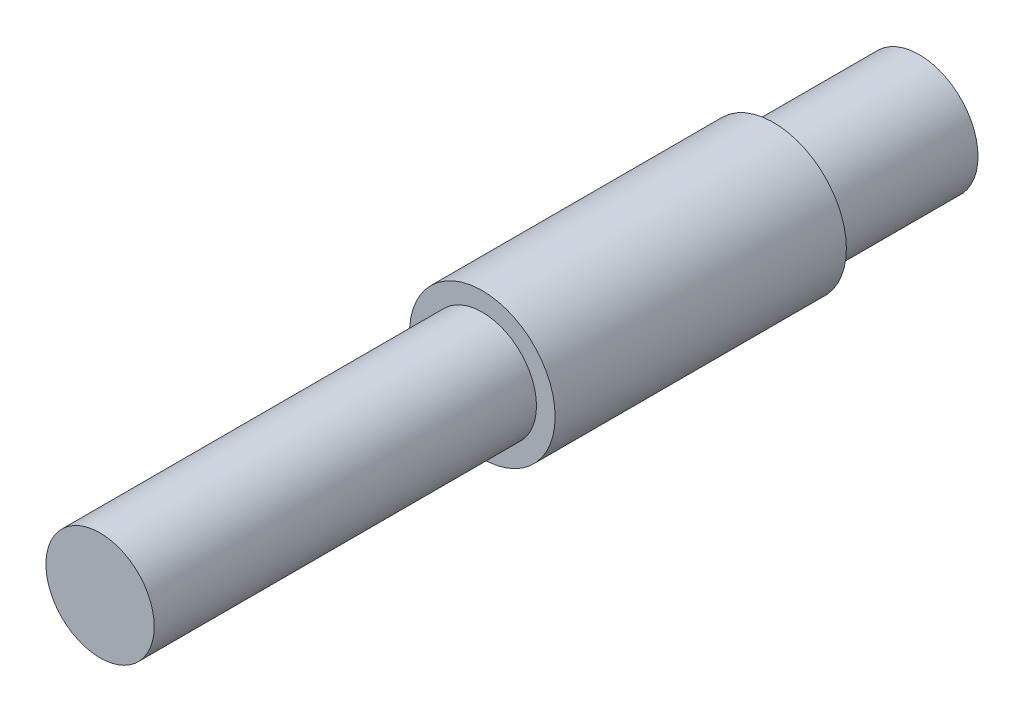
from build123d import *


with BuildPart() as part:
    # Sketch1 → Revolve1 (revolve)
    with BuildSketch(Plane(origin=(0, 0, 0), x_dir=(0, 0, -1), z_dir=(1, 0, 0)), mode=Mode.PRIVATE) as revolve1_sk:
        Polygon((-8.9296875, 0), (-8.9296875, 1.1811), (-0.5953125, 1.1811), (-0.5953125, 1.5875), (5.7546875, 1.5875), (5.7546875, 1.2827), (8.9296875, 1.2827), (8.9296875, 0), align=None)
    revolve(revolve1_sk.sketch.rotate(Axis((0, 0, 15.569748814), (0, 0, -1)), 90), axis=Axis((0, 0, 15.569748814), (0, 0, -1)))


solid = part.part
